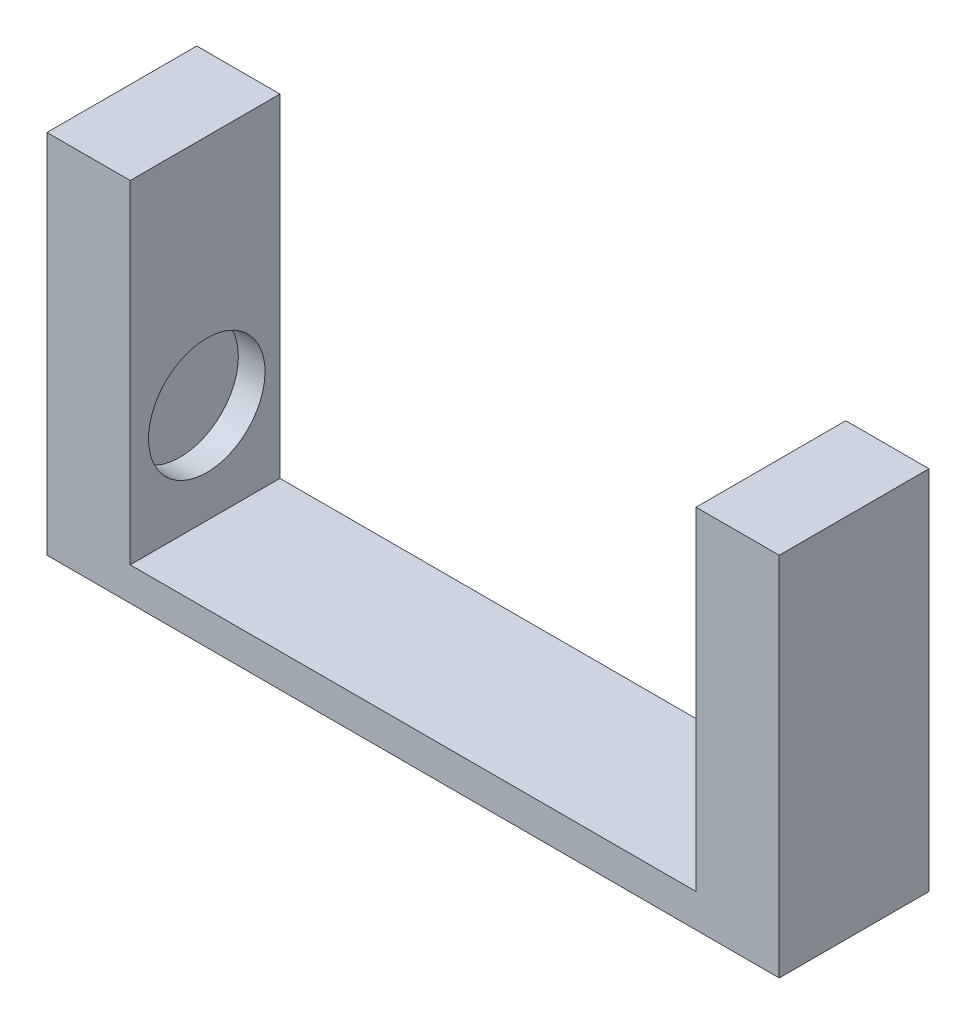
from build123d import *

# Parameters (mm, degrees)
ESQUISSE1_W      = 220
ESQUISSE1_H      = 110
EXTRUSION1_DEPTH = 45
ESQUISSE2_W      = 170
ESQUISSE2_H      = 100
EXTRUSION2_DEPTH = 65
ESQUISSE3_R      = 17.5
EXTRUSION3_DEPTH = 8
ESQUISSE6_R      = 17.5
EXTRUSION4_DEPTH = 8


with BuildPart() as part:
    # Esquisse1 → Extrusion1 (new body)
    with BuildSketch(Plane.XY):
        with Locations((110, 55)):
            Rectangle(ESQUISSE1_W, ESQUISSE1_H)
    extrude(amount=EXTRUSION1_DEPTH)

    # Esquisse2 → Extrusion2 (cut)
    with BuildSketch(Plane.XY.offset(45)):
        with Locations((110, 60)):
            Rectangle(ESQUISSE2_W, ESQUISSE2_H)
    extrude(amount=-EXTRUSION2_DEPTH, mode=Mode.SUBTRACT)

    # Esquisse3 → Extrusion3 (cut)
    with BuildSketch(Plane.ZY.offset(-195)):
        with Locations((23, 40)):
            Circle(ESQUISSE3_R)
    extrude(amount=-EXTRUSION3_DEPTH, mode=Mode.SUBTRACT)

    # Esquisse6 → Extrusion4 (cut)
    with BuildSketch(Plane(origin=(25, 0, 0), x_dir=(0, 0, -1), z_dir=(1, 0, 0))):
        with Locations(Location((-22, 40, 0), (0, 0, 90))):
            Circle(ESQUISSE6_R)
    extrude(amount=-EXTRUSION4_DEPTH, mode=Mode.SUBTRACT)


solid = part.part
